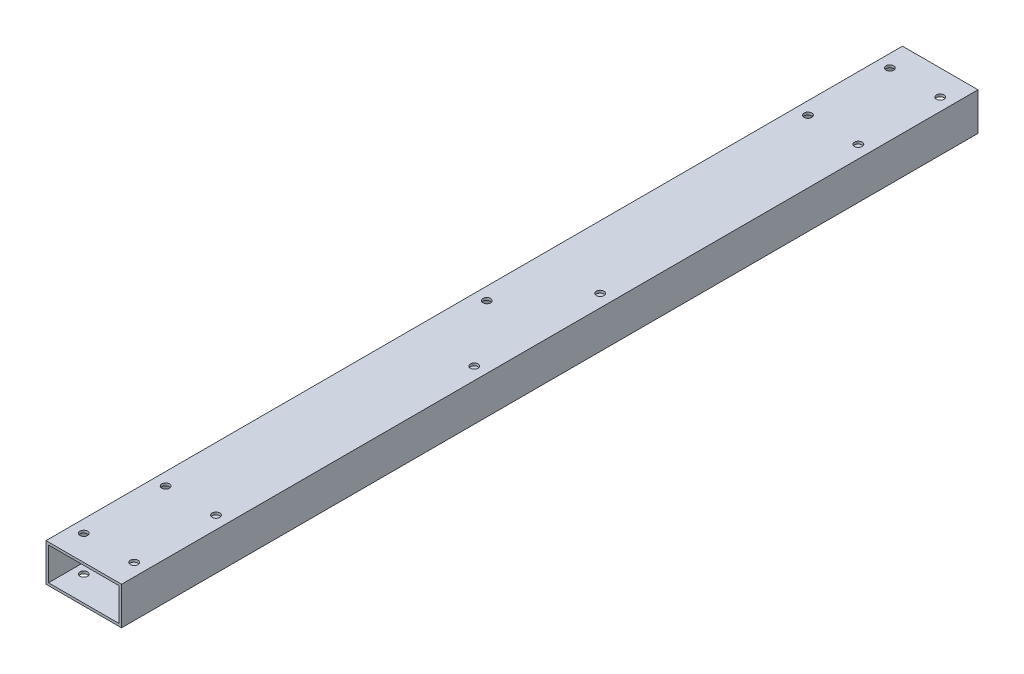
ISO-10303-21;
HEADER;
FILE_DESCRIPTION(('STEP AP214'),'2;1');
FILE_NAME('part.step','',(''),(''),'','','');
FILE_SCHEMA(('AUTOMOTIVE_DESIGN { 1 0 10303 214 1 1 1 1 }'));
ENDSEC;
DATA;
#1=APPLICATION_CONTEXT('core data for automotive mechanical design processes');
#2=APPLICATION_PROTOCOL_DEFINITION('international standard','automotive_design',2000,#1);
#3=PRODUCT_CONTEXT('',#1,'mechanical');
#4=PRODUCT('Part','Part','',(#3));
#5=PRODUCT_RELATED_PRODUCT_CATEGORY('part','',(#4));
#6=PRODUCT_DEFINITION_FORMATION('','',#4);
#7=PRODUCT_DEFINITION_CONTEXT('part definition',#1,'design');
#8=PRODUCT_DEFINITION('design','',#6,#7);
#9=PRODUCT_DEFINITION_SHAPE('','',#8);
#10=(LENGTH_UNIT() NAMED_UNIT(*) SI_UNIT(.MILLI.,.METRE.));
#11=(NAMED_UNIT(*) PLANE_ANGLE_UNIT() SI_UNIT($,.RADIAN.));
#12=(NAMED_UNIT(*) SI_UNIT($,.STERADIAN.) SOLID_ANGLE_UNIT());
#13=UNCERTAINTY_MEASURE_WITH_UNIT(LENGTH_MEASURE(1.E-05),#10,'distance_accuracy_value','');
#14=(GEOMETRIC_REPRESENTATION_CONTEXT(3) GLOBAL_UNCERTAINTY_ASSIGNED_CONTEXT((#13)) GLOBAL_UNIT_ASSIGNED_CONTEXT((#10,
#11,#12)) REPRESENTATION_CONTEXT('',''));
#15=CARTESIAN_POINT('',(0.,0.,0.));
#16=DIRECTION('',(0.,0.,1.));
#17=DIRECTION('',(1.,0.,0.));
#18=AXIS2_PLACEMENT_3D('',#15,#16,#17);
#19=CARTESIAN_POINT('',(0.,0.,340.));
#20=DIRECTION('',(0.,0.,1.));
#21=DIRECTION('',(1.,0.,0.));
#22=AXIS2_PLACEMENT_3D('',#19,#20,#21);
#23=PLANE('',#22);
#24=DIRECTION('',(0.,-1.,0.));
#25=VECTOR('',#24,1.);
#26=CARTESIAN_POINT('',(-30.,15.,340.));
#27=LINE('',#26,#25);
#28=CARTESIAN_POINT('',(-30.,15.,340.));
#29=VERTEX_POINT('',#28);
#30=CARTESIAN_POINT('',(-30.,-15.,340.));
#31=VERTEX_POINT('',#30);
#32=EDGE_CURVE('E198',#29,#31,#27,.T.);
#33=ORIENTED_EDGE('',*,*,#32,.T.);
#34=DIRECTION('',(1.,0.,0.));
#35=VECTOR('',#34,1.);
#36=CARTESIAN_POINT('',(-30.,-15.,340.));
#37=LINE('',#36,#35);
#38=CARTESIAN_POINT('',(30.,-15.,340.));
#39=VERTEX_POINT('',#38);
#40=EDGE_CURVE('E202',#31,#39,#37,.T.);
#41=ORIENTED_EDGE('',*,*,#40,.T.);
#42=DIRECTION('',(0.,1.,0.));
#43=VECTOR('',#42,1.);
#44=CARTESIAN_POINT('',(30.,15.,340.));
#45=LINE('',#44,#43);
#46=CARTESIAN_POINT('',(30.,15.,340.));
#47=VERTEX_POINT('',#46);
#48=EDGE_CURVE('E206',#39,#47,#45,.T.);
#49=ORIENTED_EDGE('',*,*,#48,.T.);
#50=DIRECTION('',(-1.,0.,0.));
#51=VECTOR('',#50,1.);
#52=CARTESIAN_POINT('',(-30.,15.,340.));
#53=LINE('',#52,#51);
#54=EDGE_CURVE('E209',#47,#29,#53,.T.);
#55=ORIENTED_EDGE('',*,*,#54,.T.);
#56=EDGE_LOOP('',(#33,#41,#49,#55));
#57=FACE_BOUND('',#56,.T.);
#58=DIRECTION('',(1.,0.,0.));
#59=VECTOR('',#58,1.);
#60=CARTESIAN_POINT('',(-28.,-13.,340.));
#61=LINE('',#60,#59);
#62=CARTESIAN_POINT('',(-28.,-13.,340.));
#63=VERTEX_POINT('',#62);
#64=CARTESIAN_POINT('',(28.,-13.,340.));
#65=VERTEX_POINT('',#64);
#66=EDGE_CURVE('E143',#63,#65,#61,.T.);
#67=ORIENTED_EDGE('',*,*,#66,.F.);
#68=DIRECTION('',(0.,-1.,0.));
#69=VECTOR('',#68,1.);
#70=CARTESIAN_POINT('',(-28.,13.,340.));
#71=LINE('',#70,#69);
#72=CARTESIAN_POINT('',(-28.,13.,340.));
#73=VERTEX_POINT('',#72);
#74=EDGE_CURVE('E133',#73,#63,#71,.T.);
#75=ORIENTED_EDGE('',*,*,#74,.F.);
#76=DIRECTION('',(-1.,0.,0.));
#77=VECTOR('',#76,1.);
#78=CARTESIAN_POINT('',(-28.,13.,340.));
#79=LINE('',#78,#77);
#80=CARTESIAN_POINT('',(28.,13.,340.));
#81=VERTEX_POINT('',#80);
#82=EDGE_CURVE('E163',#81,#73,#79,.T.);
#83=ORIENTED_EDGE('',*,*,#82,.F.);
#84=DIRECTION('',(0.,1.,0.));
#85=VECTOR('',#84,1.);
#86=CARTESIAN_POINT('',(28.,13.,340.));
#87=LINE('',#86,#85);
#88=EDGE_CURVE('E159',#65,#81,#87,.T.);
#89=ORIENTED_EDGE('',*,*,#88,.F.);
#90=EDGE_LOOP('',(#67,#75,#83,#89));
#91=FACE_BOUND('',#90,.T.);
#92=ADVANCED_FACE('F45',(#57,#91),#23,.T.);
#93=CARTESIAN_POINT('',(0.,0.,-340.));
#94=DIRECTION('',(0.,0.,1.));
#95=DIRECTION('',(1.,0.,0.));
#96=AXIS2_PLACEMENT_3D('',#93,#94,#95);
#97=PLANE('',#96);
#98=DIRECTION('',(0.,-1.,0.));
#99=VECTOR('',#98,1.);
#100=CARTESIAN_POINT('',(-30.,15.,-340.));
#101=LINE('',#100,#99);
#102=CARTESIAN_POINT('',(-30.,15.,-340.));
#103=VERTEX_POINT('',#102);
#104=CARTESIAN_POINT('',(-30.,-15.,-340.));
#105=VERTEX_POINT('',#104);
#106=EDGE_CURVE('E153',#103,#105,#101,.T.);
#107=ORIENTED_EDGE('',*,*,#106,.F.);
#108=DIRECTION('',(-1.,0.,0.));
#109=VECTOR('',#108,1.);
#110=CARTESIAN_POINT('',(-30.,15.,-340.));
#111=LINE('',#110,#109);
#112=CARTESIAN_POINT('',(30.,15.,-340.));
#113=VERTEX_POINT('',#112);
#114=EDGE_CURVE('E203',#113,#103,#111,.T.);
#115=ORIENTED_EDGE('',*,*,#114,.F.);
#116=DIRECTION('',(0.,1.,0.));
#117=VECTOR('',#116,1.);
#118=CARTESIAN_POINT('',(30.,15.,-340.));
#119=LINE('',#118,#117);
#120=CARTESIAN_POINT('',(30.,-15.,-340.));
#121=VERTEX_POINT('',#120);
#122=EDGE_CURVE('E219',#121,#113,#119,.T.);
#123=ORIENTED_EDGE('',*,*,#122,.F.);
#124=DIRECTION('',(1.,0.,0.));
#125=VECTOR('',#124,1.);
#126=CARTESIAN_POINT('',(-30.,-15.,-340.));
#127=LINE('',#126,#125);
#128=EDGE_CURVE('E216',#105,#121,#127,.T.);
#129=ORIENTED_EDGE('',*,*,#128,.F.);
#130=EDGE_LOOP('',(#107,#115,#123,#129));
#131=FACE_BOUND('',#130,.T.);
#132=DIRECTION('',(0.,-1.,0.));
#133=VECTOR('',#132,1.);
#134=CARTESIAN_POINT('',(-28.,13.,-340.));
#135=LINE('',#134,#133);
#136=CARTESIAN_POINT('',(-28.,13.,-340.));
#137=VERTEX_POINT('',#136);
#138=CARTESIAN_POINT('',(-28.,-13.,-340.));
#139=VERTEX_POINT('',#138);
#140=EDGE_CURVE('E169',#137,#139,#135,.T.);
#141=ORIENTED_EDGE('',*,*,#140,.T.);
#142=DIRECTION('',(1.,0.,0.));
#143=VECTOR('',#142,1.);
#144=CARTESIAN_POINT('',(-28.,-13.,-340.));
#145=LINE('',#144,#143);
#146=CARTESIAN_POINT('',(28.,-13.,-340.));
#147=VERTEX_POINT('',#146);
#148=EDGE_CURVE('E173',#139,#147,#145,.T.);
#149=ORIENTED_EDGE('',*,*,#148,.T.);
#150=DIRECTION('',(0.,1.,0.));
#151=VECTOR('',#150,1.);
#152=CARTESIAN_POINT('',(28.,13.,-340.));
#153=LINE('',#152,#151);
#154=CARTESIAN_POINT('',(28.,13.,-340.));
#155=VERTEX_POINT('',#154);
#156=EDGE_CURVE('E178',#147,#155,#153,.T.);
#157=ORIENTED_EDGE('',*,*,#156,.T.);
#158=DIRECTION('',(-1.,0.,0.));
#159=VECTOR('',#158,1.);
#160=CARTESIAN_POINT('',(-28.,13.,-340.));
#161=LINE('',#160,#159);
#162=EDGE_CURVE('E144',#155,#137,#161,.T.);
#163=ORIENTED_EDGE('',*,*,#162,.T.);
#164=EDGE_LOOP('',(#141,#149,#157,#163));
#165=FACE_BOUND('',#164,.T.);
#166=ADVANCED_FACE('F391',(#131,#165),#97,.F.);
#167=CARTESIAN_POINT('',(-30.,15.,340.));
#168=DIRECTION('',(1.,0.,0.));
#169=DIRECTION('',(0.,0.,-1.));
#170=AXIS2_PLACEMENT_3D('',#167,#168,#169);
#171=PLANE('',#170);
#172=ORIENTED_EDGE('',*,*,#106,.T.);
#173=DIRECTION('',(0.,0.,-1.));
#174=VECTOR('',#173,1.);
#175=CARTESIAN_POINT('',(-30.,-15.,340.));
#176=LINE('',#175,#174);
#177=EDGE_CURVE('E11',#31,#105,#176,.T.);
#178=ORIENTED_EDGE('',*,*,#177,.F.);
#179=ORIENTED_EDGE('',*,*,#32,.F.);
#180=DIRECTION('',(0.,0.,-1.));
#181=VECTOR('',#180,1.);
#182=CARTESIAN_POINT('',(-30.,15.,340.));
#183=LINE('',#182,#181);
#184=EDGE_CURVE('E212',#29,#103,#183,.T.);
#185=ORIENTED_EDGE('',*,*,#184,.T.);
#186=EDGE_LOOP('',(#172,#178,#179,#185));
#187=FACE_BOUND('',#186,.T.);
#188=ADVANCED_FACE('F47',(#187),#171,.F.);
#189=CARTESIAN_POINT('',(-30.,-15.,340.));
#190=DIRECTION('',(0.,1.,0.));
#191=DIRECTION('',(0.,0.,1.));
#192=AXIS2_PLACEMENT_3D('',#189,#190,#191);
#193=PLANE('',#192);
#194=CARTESIAN_POINT('',(20.,-15.,50.));
#195=DIRECTION('',(0.,-1.,0.));
#196=DIRECTION('',(0.,0.,-1.));
#197=AXIS2_PLACEMENT_3D('',#194,#195,#196);
#198=CIRCLE('',#197,8.00000000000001);
#199=CARTESIAN_POINT('',(20.,-15.,42.));
#200=VERTEX_POINT('',#199);
#201=EDGE_CURVE('E419',#200,#200,#198,.T.);
#202=ORIENTED_EDGE('',*,*,#201,.F.);
#203=EDGE_LOOP('',(#202));
#204=FACE_BOUND('',#203,.T.);
#205=CARTESIAN_POINT('',(-20.,-15.,255.));
#206=DIRECTION('',(0.,-1.,0.));
#207=DIRECTION('',(0.,0.,-1.));
#208=AXIS2_PLACEMENT_3D('',#205,#206,#207);
#209=CIRCLE('',#208,8.00000000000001);
#210=CARTESIAN_POINT('',(-20.,-15.,247.));
#211=VERTEX_POINT('',#210);
#212=EDGE_CURVE('E423',#211,#211,#209,.T.);
#213=ORIENTED_EDGE('',*,*,#212,.F.);
#214=EDGE_LOOP('',(#213));
#215=FACE_BOUND('',#214,.T.);
#216=CARTESIAN_POINT('',(20.,-15.,255.));
#217=DIRECTION('',(0.,-1.,0.));
#218=DIRECTION('',(0.,0.,-1.));
#219=AXIS2_PLACEMENT_3D('',#216,#217,#218);
#220=CIRCLE('',#219,8.00000000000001);
#221=CARTESIAN_POINT('',(20.,-15.,247.));
#222=VERTEX_POINT('',#221);
#223=EDGE_CURVE('E427',#222,#222,#220,.T.);
#224=ORIENTED_EDGE('',*,*,#223,.F.);
#225=EDGE_LOOP('',(#224));
#226=FACE_BOUND('',#225,.T.);
#227=CARTESIAN_POINT('',(20.,-15.,320.));
#228=DIRECTION('',(0.,-1.,0.));
#229=DIRECTION('',(0.,0.,-1.));
#230=AXIS2_PLACEMENT_3D('',#227,#228,#229);
#231=CIRCLE('',#230,3.05000000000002);
#232=CARTESIAN_POINT('',(20.,-15.,316.95));
#233=VERTEX_POINT('',#232);
#234=EDGE_CURVE('E431',#233,#233,#231,.T.);
#235=ORIENTED_EDGE('',*,*,#234,.F.);
#236=EDGE_LOOP('',(#235));
#237=FACE_BOUND('',#236,.T.);
#238=CARTESIAN_POINT('',(-20.,-15.,320.));
#239=DIRECTION('',(0.,-1.,0.));
#240=DIRECTION('',(0.,0.,-1.));
#241=AXIS2_PLACEMENT_3D('',#238,#239,#240);
#242=CIRCLE('',#241,3.05000000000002);
#243=CARTESIAN_POINT('',(-20.,-15.,316.95));
#244=VERTEX_POINT('',#243);
#245=EDGE_CURVE('E271',#244,#244,#242,.T.);
#246=ORIENTED_EDGE('',*,*,#245,.F.);
#247=EDGE_LOOP('',(#246));
#248=FACE_BOUND('',#247,.T.);
#249=CARTESIAN_POINT('',(-19.9999999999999,-15.,0.));
#250=DIRECTION('',(0.,1.,0.));
#251=DIRECTION('',(0.,0.,1.));
#252=AXIS2_PLACEMENT_3D('',#249,#250,#251);
#253=CIRCLE('',#252,7.99999999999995);
#254=CARTESIAN_POINT('',(-19.9999999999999,-15.,7.99999999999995));
#255=VERTEX_POINT('',#254);
#256=EDGE_CURVE('E306',#255,#255,#253,.T.);
#257=ORIENTED_EDGE('',*,*,#256,.T.);
#258=EDGE_LOOP('',(#257));
#259=FACE_BOUND('',#258,.T.);
#260=CARTESIAN_POINT('',(20.,-15.,-50.));
#261=DIRECTION('',(0.,1.,0.));
#262=DIRECTION('',(0.,0.,1.));
#263=AXIS2_PLACEMENT_3D('',#260,#261,#262);
#264=CIRCLE('',#263,8.00000000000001);
#265=CARTESIAN_POINT('',(20.,-15.,-42.));
#266=VERTEX_POINT('',#265);
#267=EDGE_CURVE('E312',#266,#266,#264,.T.);
#268=ORIENTED_EDGE('',*,*,#267,.T.);
#269=EDGE_LOOP('',(#268));
#270=FACE_BOUND('',#269,.T.);
#271=CARTESIAN_POINT('',(-20.,-15.,-255.));
#272=DIRECTION('',(0.,1.,0.));
#273=DIRECTION('',(0.,0.,1.));
#274=AXIS2_PLACEMENT_3D('',#271,#272,#273);
#275=CIRCLE('',#274,8.00000000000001);
#276=CARTESIAN_POINT('',(-20.,-15.,-247.));
#277=VERTEX_POINT('',#276);
#278=EDGE_CURVE('E307',#277,#277,#275,.T.);
#279=ORIENTED_EDGE('',*,*,#278,.T.);
#280=EDGE_LOOP('',(#279));
#281=FACE_BOUND('',#280,.T.);
#282=CARTESIAN_POINT('',(20.,-15.,-255.));
#283=DIRECTION('',(0.,1.,0.));
#284=DIRECTION('',(0.,0.,1.));
#285=AXIS2_PLACEMENT_3D('',#282,#283,#284);
#286=CIRCLE('',#285,8.00000000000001);
#287=CARTESIAN_POINT('',(20.,-15.,-247.));
#288=VERTEX_POINT('',#287);
#289=EDGE_CURVE('E311',#288,#288,#286,.T.);
#290=ORIENTED_EDGE('',*,*,#289,.T.);
#291=EDGE_LOOP('',(#290));
#292=FACE_BOUND('',#291,.T.);
#293=CARTESIAN_POINT('',(20.,-15.,-320.));
#294=DIRECTION('',(0.,1.,0.));
#295=DIRECTION('',(0.,0.,1.));
#296=AXIS2_PLACEMENT_3D('',#293,#294,#295);
#297=CIRCLE('',#296,3.05000000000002);
#298=CARTESIAN_POINT('',(20.,-15.,-316.95));
#299=VERTEX_POINT('',#298);
#300=EDGE_CURVE('E338',#299,#299,#297,.T.);
#301=ORIENTED_EDGE('',*,*,#300,.T.);
#302=EDGE_LOOP('',(#301));
#303=FACE_BOUND('',#302,.T.);
#304=CARTESIAN_POINT('',(-20.,-15.,-320.));
#305=DIRECTION('',(0.,1.,0.));
#306=DIRECTION('',(0.,0.,1.));
#307=AXIS2_PLACEMENT_3D('',#304,#305,#306);
#308=CIRCLE('',#307,3.05000000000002);
#309=CARTESIAN_POINT('',(-20.,-15.,-316.95));
#310=VERTEX_POINT('',#309);
#311=EDGE_CURVE('E239',#310,#310,#308,.T.);
#312=ORIENTED_EDGE('',*,*,#311,.T.);
#313=EDGE_LOOP('',(#312));
#314=FACE_BOUND('',#313,.T.);
#315=ORIENTED_EDGE('',*,*,#128,.T.);
#316=DIRECTION('',(0.,0.,-1.));
#317=VECTOR('',#316,1.);
#318=CARTESIAN_POINT('',(30.,-15.,340.));
#319=LINE('',#318,#317);
#320=EDGE_CURVE('E55',#39,#121,#319,.T.);
#321=ORIENTED_EDGE('',*,*,#320,.F.);
#322=ORIENTED_EDGE('',*,*,#40,.F.);
#323=ORIENTED_EDGE('',*,*,#177,.T.);
#324=EDGE_LOOP('',(#315,#321,#322,#323));
#325=FACE_BOUND('',#324,.T.);
#326=ADVANCED_FACE('F407',(#204,#215,#226,#237,#248,#259,#270,#281,#292,#303,#314,#325),#193,.F.);
#327=CARTESIAN_POINT('',(30.,15.,340.));
#328=DIRECTION('',(-1.,0.,0.));
#329=DIRECTION('',(0.,0.,1.));
#330=AXIS2_PLACEMENT_3D('',#327,#328,#329);
#331=PLANE('',#330);
#332=ORIENTED_EDGE('',*,*,#122,.T.);
#333=DIRECTION('',(0.,0.,-1.));
#334=VECTOR('',#333,1.);
#335=CARTESIAN_POINT('',(30.,15.,340.));
#336=LINE('',#335,#334);
#337=EDGE_CURVE('E227',#47,#113,#336,.T.);
#338=ORIENTED_EDGE('',*,*,#337,.F.);
#339=ORIENTED_EDGE('',*,*,#48,.F.);
#340=ORIENTED_EDGE('',*,*,#320,.T.);
#341=EDGE_LOOP('',(#332,#338,#339,#340));
#342=FACE_BOUND('',#341,.T.);
#343=ADVANCED_FACE('F404',(#342),#331,.F.);
#344=CARTESIAN_POINT('',(-30.,15.,340.));
#345=DIRECTION('',(0.,-1.,0.));
#346=DIRECTION('',(0.,0.,-1.));
#347=AXIS2_PLACEMENT_3D('',#344,#345,#346);
#348=PLANE('',#347);
#349=CARTESIAN_POINT('',(20.,15.,255.));
#350=DIRECTION('',(0.,-1.,0.));
#351=DIRECTION('',(0.,0.,-1.));
#352=AXIS2_PLACEMENT_3D('',#349,#350,#351);
#353=CIRCLE('',#352,3.05000000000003);
#354=CARTESIAN_POINT('',(20.,15.,251.95));
#355=VERTEX_POINT('',#354);
#356=EDGE_CURVE('E302',#355,#355,#353,.F.);
#357=ORIENTED_EDGE('',*,*,#356,.F.);
#358=EDGE_LOOP('',(#357));
#359=FACE_BOUND('',#358,.T.);
#360=CARTESIAN_POINT('',(-20.,15.,255.));
#361=DIRECTION('',(0.,-1.,0.));
#362=DIRECTION('',(0.,0.,-1.));
#363=AXIS2_PLACEMENT_3D('',#360,#361,#362);
#364=CIRCLE('',#363,3.05000000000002);
#365=CARTESIAN_POINT('',(-20.,15.,251.95));
#366=VERTEX_POINT('',#365);
#367=EDGE_CURVE('E285',#366,#366,#364,.F.);
#368=ORIENTED_EDGE('',*,*,#367,.F.);
#369=EDGE_LOOP('',(#368));
#370=FACE_BOUND('',#369,.T.);
#371=CARTESIAN_POINT('',(20.,15.,320.));
#372=DIRECTION('',(0.,-1.,0.));
#373=DIRECTION('',(0.,0.,-1.));
#374=AXIS2_PLACEMENT_3D('',#371,#372,#373);
#375=CIRCLE('',#374,3.05000000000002);
#376=CARTESIAN_POINT('',(20.,15.,316.95));
#377=VERTEX_POINT('',#376);
#378=EDGE_CURVE('E286',#377,#377,#375,.F.);
#379=ORIENTED_EDGE('',*,*,#378,.F.);
#380=EDGE_LOOP('',(#379));
#381=FACE_BOUND('',#380,.T.);
#382=CARTESIAN_POINT('',(20.,15.,50.));
#383=DIRECTION('',(0.,-1.,0.));
#384=DIRECTION('',(0.,0.,-1.));
#385=AXIS2_PLACEMENT_3D('',#382,#383,#384);
#386=CIRCLE('',#385,3.05);
#387=CARTESIAN_POINT('',(20.,15.,46.95));
#388=VERTEX_POINT('',#387);
#389=EDGE_CURVE('E276',#388,#388,#386,.F.);
#390=ORIENTED_EDGE('',*,*,#389,.F.);
#391=EDGE_LOOP('',(#390));
#392=FACE_BOUND('',#391,.T.);
#393=CARTESIAN_POINT('',(-20.,15.,320.));
#394=DIRECTION('',(0.,-1.,0.));
#395=DIRECTION('',(0.,0.,-1.));
#396=AXIS2_PLACEMENT_3D('',#393,#394,#395);
#397=CIRCLE('',#396,3.05000000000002);
#398=CARTESIAN_POINT('',(-20.,15.,316.95));
#399=VERTEX_POINT('',#398);
#400=EDGE_CURVE('E277',#399,#399,#397,.F.);
#401=ORIENTED_EDGE('',*,*,#400,.F.);
#402=EDGE_LOOP('',(#401));
#403=FACE_BOUND('',#402,.T.);
#404=CARTESIAN_POINT('',(-19.9999999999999,15.,0.));
#405=DIRECTION('',(0.,-1.,0.));
#406=DIRECTION('',(0.,0.,-1.));
#407=AXIS2_PLACEMENT_3D('',#404,#405,#406);
#408=CIRCLE('',#407,3.05);
#409=CARTESIAN_POINT('',(-19.9999999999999,15.,-3.05));
#410=VERTEX_POINT('',#409);
#411=EDGE_CURVE('E174',#410,#410,#408,.T.);
#412=ORIENTED_EDGE('',*,*,#411,.T.);
#413=EDGE_LOOP('',(#412));
#414=FACE_BOUND('',#413,.T.);
#415=CARTESIAN_POINT('',(20.,15.,-255.));
#416=DIRECTION('',(0.,-1.,0.));
#417=DIRECTION('',(0.,0.,-1.));
#418=AXIS2_PLACEMENT_3D('',#415,#416,#417);
#419=CIRCLE('',#418,3.05000000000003);
#420=CARTESIAN_POINT('',(20.,15.,-258.05));
#421=VERTEX_POINT('',#420);
#422=EDGE_CURVE('E261',#421,#421,#419,.T.);
#423=ORIENTED_EDGE('',*,*,#422,.T.);
#424=EDGE_LOOP('',(#423));
#425=FACE_BOUND('',#424,.T.);
#426=CARTESIAN_POINT('',(-20.,15.,-255.));
#427=DIRECTION('',(0.,-1.,0.));
#428=DIRECTION('',(0.,0.,-1.));
#429=AXIS2_PLACEMENT_3D('',#426,#427,#428);
#430=CIRCLE('',#429,3.05000000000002);
#431=CARTESIAN_POINT('',(-20.,15.,-258.05));
#432=VERTEX_POINT('',#431);
#433=EDGE_CURVE('E255',#432,#432,#430,.T.);
#434=ORIENTED_EDGE('',*,*,#433,.T.);
#435=EDGE_LOOP('',(#434));
#436=FACE_BOUND('',#435,.T.);
#437=CARTESIAN_POINT('',(20.,15.,-320.));
#438=DIRECTION('',(0.,-1.,0.));
#439=DIRECTION('',(0.,0.,-1.));
#440=AXIS2_PLACEMENT_3D('',#437,#438,#439);
#441=CIRCLE('',#440,3.05000000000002);
#442=CARTESIAN_POINT('',(20.,15.,-323.05));
#443=VERTEX_POINT('',#442);
#444=EDGE_CURVE('E256',#443,#443,#441,.T.);
#445=ORIENTED_EDGE('',*,*,#444,.T.);
#446=EDGE_LOOP('',(#445));
#447=FACE_BOUND('',#446,.T.);
#448=CARTESIAN_POINT('',(20.,15.,-50.));
#449=DIRECTION('',(0.,-1.,0.));
#450=DIRECTION('',(0.,0.,-1.));
#451=AXIS2_PLACEMENT_3D('',#448,#449,#450);
#452=CIRCLE('',#451,3.05);
#453=CARTESIAN_POINT('',(20.,15.,-53.05));
#454=VERTEX_POINT('',#453);
#455=EDGE_CURVE('E244',#454,#454,#452,.T.);
#456=ORIENTED_EDGE('',*,*,#455,.T.);
#457=EDGE_LOOP('',(#456));
#458=FACE_BOUND('',#457,.T.);
#459=CARTESIAN_POINT('',(-20.,15.,-320.));
#460=DIRECTION('',(0.,-1.,0.));
#461=DIRECTION('',(0.,0.,-1.));
#462=AXIS2_PLACEMENT_3D('',#459,#460,#461);
#463=CIRCLE('',#462,3.05000000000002);
#464=CARTESIAN_POINT('',(-20.,15.,-323.05));
#465=VERTEX_POINT('',#464);
#466=EDGE_CURVE('E245',#465,#465,#463,.T.);
#467=ORIENTED_EDGE('',*,*,#466,.T.);
#468=EDGE_LOOP('',(#467));
#469=FACE_BOUND('',#468,.T.);
#470=ORIENTED_EDGE('',*,*,#114,.T.);
#471=ORIENTED_EDGE('',*,*,#184,.F.);
#472=ORIENTED_EDGE('',*,*,#54,.F.);
#473=ORIENTED_EDGE('',*,*,#337,.T.);
#474=EDGE_LOOP('',(#470,#471,#472,#473));
#475=FACE_BOUND('',#474,.T.);
#476=ADVANCED_FACE('F369',(#359,#370,#381,#392,#403,#414,#425,#436,#447,#458,#469,#475),#348,.F.);
#477=CARTESIAN_POINT('',(-28.,13.,340.));
#478=DIRECTION('',(1.,0.,0.));
#479=DIRECTION('',(0.,1.,0.));
#480=AXIS2_PLACEMENT_3D('',#477,#478,#479);
#481=PLANE('',#480);
#482=DIRECTION('',(0.,0.,-1.));
#483=VECTOR('',#482,1.);
#484=CARTESIAN_POINT('',(-28.,-13.,340.));
#485=LINE('',#484,#483);
#486=CARTESIAN_POINT('',(-28.,-13.,255.));
#487=VERTEX_POINT('',#486);
#488=EDGE_CURVE('E136',#63,#487,#485,.T.);
#489=ORIENTED_EDGE('',*,*,#488,.T.);
#490=CARTESIAN_POINT('',(-28.,-13.,0.));
#491=VERTEX_POINT('',#490);
#492=EDGE_CURVE('E154',#487,#491,#485,.T.);
#493=ORIENTED_EDGE('',*,*,#492,.T.);
#494=CARTESIAN_POINT('',(-28.,-13.,-255.));
#495=VERTEX_POINT('',#494);
#496=EDGE_CURVE('E156',#491,#495,#485,.T.);
#497=ORIENTED_EDGE('',*,*,#496,.T.);
#498=EDGE_CURVE('E193',#495,#139,#485,.T.);
#499=ORIENTED_EDGE('',*,*,#498,.T.);
#500=ORIENTED_EDGE('',*,*,#140,.F.);
#501=DIRECTION('',(0.,0.,-1.));
#502=VECTOR('',#501,1.);
#503=CARTESIAN_POINT('',(-28.,13.,340.));
#504=LINE('',#503,#502);
#505=EDGE_CURVE('E138',#73,#137,#504,.T.);
#506=ORIENTED_EDGE('',*,*,#505,.F.);
#507=ORIENTED_EDGE('',*,*,#74,.T.);
#508=EDGE_LOOP('',(#489,#493,#497,#499,#500,#506,#507));
#509=FACE_BOUND('',#508,.T.);
#510=ADVANCED_FACE('F135',(#509),#481,.T.);
#511=CARTESIAN_POINT('',(-28.,-13.,340.));
#512=DIRECTION('',(0.,1.,0.));
#513=DIRECTION('',(0.,0.,1.));
#514=AXIS2_PLACEMENT_3D('',#511,#512,#513);
#515=PLANE('',#514);
#516=CARTESIAN_POINT('',(20.,-13.,320.));
#517=DIRECTION('',(0.,1.,0.));
#518=DIRECTION('',(0.,0.,1.));
#519=AXIS2_PLACEMENT_3D('',#516,#517,#518);
#520=CIRCLE('',#519,3.05000000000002);
#521=CARTESIAN_POINT('',(20.,-13.,323.05));
#522=VERTEX_POINT('',#521);
#523=EDGE_CURVE('E281',#522,#522,#520,.F.);
#524=ORIENTED_EDGE('',*,*,#523,.T.);
#525=EDGE_LOOP('',(#524));
#526=FACE_BOUND('',#525,.T.);
#527=CARTESIAN_POINT('',(-20.,-13.,320.));
#528=DIRECTION('',(0.,1.,0.));
#529=DIRECTION('',(0.,0.,1.));
#530=AXIS2_PLACEMENT_3D('',#527,#528,#529);
#531=CIRCLE('',#530,3.05000000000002);
#532=CARTESIAN_POINT('',(-20.,-13.,323.05));
#533=VERTEX_POINT('',#532);
#534=EDGE_CURVE('E270',#533,#533,#531,.F.);
#535=ORIENTED_EDGE('',*,*,#534,.T.);
#536=EDGE_LOOP('',(#535));
#537=FACE_BOUND('',#536,.T.);
#538=CARTESIAN_POINT('',(20.,-13.,-320.));
#539=DIRECTION('',(0.,1.,0.));
#540=DIRECTION('',(0.,0.,1.));
#541=AXIS2_PLACEMENT_3D('',#538,#539,#540);
#542=CIRCLE('',#541,3.05000000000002);
#543=CARTESIAN_POINT('',(20.,-13.,-316.95));
#544=VERTEX_POINT('',#543);
#545=EDGE_CURVE('E250',#544,#544,#542,.T.);
#546=ORIENTED_EDGE('',*,*,#545,.F.);
#547=EDGE_LOOP('',(#546));
#548=FACE_BOUND('',#547,.T.);
#549=CARTESIAN_POINT('',(-20.,-13.,-320.));
#550=DIRECTION('',(0.,1.,0.));
#551=DIRECTION('',(0.,0.,1.));
#552=AXIS2_PLACEMENT_3D('',#549,#550,#551);
#553=CIRCLE('',#552,3.05000000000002);
#554=CARTESIAN_POINT('',(-20.,-13.,-316.95));
#555=VERTEX_POINT('',#554);
#556=EDGE_CURVE('E238',#555,#555,#553,.T.);
#557=ORIENTED_EDGE('',*,*,#556,.F.);
#558=EDGE_LOOP('',(#557));
#559=FACE_BOUND('',#558,.T.);
#560=DIRECTION('',(0.,0.,-1.));
#561=VECTOR('',#560,1.);
#562=CARTESIAN_POINT('',(28.,-13.,340.));
#563=LINE('',#562,#561);
#564=CARTESIAN_POINT('',(28.,-13.,255.));
#565=VERTEX_POINT('',#564);
#566=CARTESIAN_POINT('',(28.,-13.,50.));
#567=VERTEX_POINT('',#566);
#568=EDGE_CURVE('E194',#565,#567,#563,.T.);
#569=ORIENTED_EDGE('',*,*,#568,.T.);
#570=CARTESIAN_POINT('',(20.,-13.,50.));
#571=DIRECTION('',(0.,1.,0.));
#572=DIRECTION('',(0.,0.,1.));
#573=AXIS2_PLACEMENT_3D('',#570,#571,#572);
#574=CIRCLE('',#573,8.00000000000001);
#575=EDGE_CURVE('E66',#567,#567,#574,.T.);
#576=ORIENTED_EDGE('',*,*,#575,.F.);
#577=CARTESIAN_POINT('',(28.,-13.,-50.));
#578=VERTEX_POINT('',#577);
#579=EDGE_CURVE('E195',#567,#578,#563,.T.);
#580=ORIENTED_EDGE('',*,*,#579,.T.);
#581=CARTESIAN_POINT('',(20.,-13.,-50.));
#582=DIRECTION('',(0.,1.,0.));
#583=DIRECTION('',(0.,0.,1.));
#584=AXIS2_PLACEMENT_3D('',#581,#582,#583);
#585=CIRCLE('',#584,8.00000000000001);
#586=EDGE_CURVE('E330',#578,#578,#585,.F.);
#587=ORIENTED_EDGE('',*,*,#586,.T.);
#588=CARTESIAN_POINT('',(28.,-13.,-255.));
#589=VERTEX_POINT('',#588);
#590=EDGE_CURVE('E196',#578,#589,#563,.T.);
#591=ORIENTED_EDGE('',*,*,#590,.T.);
#592=CARTESIAN_POINT('',(20.,-13.,-255.));
#593=DIRECTION('',(0.,1.,0.));
#594=DIRECTION('',(0.,0.,1.));
#595=AXIS2_PLACEMENT_3D('',#592,#593,#594);
#596=CIRCLE('',#595,8.00000000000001);
#597=EDGE_CURVE('E322',#589,#589,#596,.F.);
#598=ORIENTED_EDGE('',*,*,#597,.T.);
#599=EDGE_CURVE('E190',#589,#147,#563,.T.);
#600=ORIENTED_EDGE('',*,*,#599,.T.);
#601=ORIENTED_EDGE('',*,*,#148,.F.);
#602=ORIENTED_EDGE('',*,*,#498,.F.);
#603=CARTESIAN_POINT('',(-20.,-13.,-255.));
#604=DIRECTION('',(0.,1.,0.));
#605=DIRECTION('',(0.,0.,1.));
#606=AXIS2_PLACEMENT_3D('',#603,#604,#605);
#607=CIRCLE('',#606,8.00000000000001);
#608=EDGE_CURVE('E326',#495,#495,#607,.F.);
#609=ORIENTED_EDGE('',*,*,#608,.T.);
#610=ORIENTED_EDGE('',*,*,#496,.F.);
#611=CARTESIAN_POINT('',(-19.9999999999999,-13.,0.));
#612=DIRECTION('',(0.,1.,0.));
#613=DIRECTION('',(0.,0.,1.));
#614=AXIS2_PLACEMENT_3D('',#611,#612,#613);
#615=CIRCLE('',#614,7.99999999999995);
#616=EDGE_CURVE('E334',#491,#491,#615,.F.);
#617=ORIENTED_EDGE('',*,*,#616,.T.);
#618=ORIENTED_EDGE('',*,*,#492,.F.);
#619=CARTESIAN_POINT('',(-20.,-13.,255.));
#620=DIRECTION('',(0.,1.,0.));
#621=DIRECTION('',(0.,0.,1.));
#622=AXIS2_PLACEMENT_3D('',#619,#620,#621);
#623=CIRCLE('',#622,8.00000000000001);
#624=EDGE_CURVE('E61',#487,#487,#623,.T.);
#625=ORIENTED_EDGE('',*,*,#624,.F.);
#626=ORIENTED_EDGE('',*,*,#488,.F.);
#627=ORIENTED_EDGE('',*,*,#66,.T.);
#628=EDGE_CURVE('E191',#65,#565,#563,.T.);
#629=ORIENTED_EDGE('',*,*,#628,.T.);
#630=CARTESIAN_POINT('',(20.,-13.,255.));
#631=DIRECTION('',(0.,1.,0.));
#632=DIRECTION('',(0.,0.,1.));
#633=AXIS2_PLACEMENT_3D('',#630,#631,#632);
#634=CIRCLE('',#633,8.00000000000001);
#635=EDGE_CURVE('E517',#565,#565,#634,.T.);
#636=ORIENTED_EDGE('',*,*,#635,.F.);
#637=EDGE_LOOP('',(#569,#576,#580,#587,#591,#598,#600,#601,#602,#609,#610,#617,#618,#625,#626,
#627,#629,#636));
#638=FACE_BOUND('',#637,.T.);
#639=ADVANCED_FACE('F148',(#526,#537,#548,#559,#638),#515,.T.);
#640=CARTESIAN_POINT('',(28.,13.,340.));
#641=DIRECTION('',(-1.,0.,0.));
#642=DIRECTION('',(0.,0.,1.));
#643=AXIS2_PLACEMENT_3D('',#640,#641,#642);
#644=PLANE('',#643);
#645=ORIENTED_EDGE('',*,*,#579,.F.);
#646=ORIENTED_EDGE('',*,*,#568,.F.);
#647=ORIENTED_EDGE('',*,*,#628,.F.);
#648=ORIENTED_EDGE('',*,*,#88,.T.);
#649=DIRECTION('',(0.,0.,-1.));
#650=VECTOR('',#649,1.);
#651=CARTESIAN_POINT('',(28.,13.,340.));
#652=LINE('',#651,#650);
#653=EDGE_CURVE('E187',#81,#155,#652,.T.);
#654=ORIENTED_EDGE('',*,*,#653,.T.);
#655=ORIENTED_EDGE('',*,*,#156,.F.);
#656=ORIENTED_EDGE('',*,*,#599,.F.);
#657=ORIENTED_EDGE('',*,*,#590,.F.);
#658=EDGE_LOOP('',(#645,#646,#647,#648,#654,#655,#656,#657));
#659=FACE_BOUND('',#658,.T.);
#660=ADVANCED_FACE('F472',(#659),#644,.T.);
#661=CARTESIAN_POINT('',(-28.,13.,340.));
#662=DIRECTION('',(0.,-1.,0.));
#663=DIRECTION('',(0.,0.,-1.));
#664=AXIS2_PLACEMENT_3D('',#661,#662,#663);
#665=PLANE('',#664);
#666=CARTESIAN_POINT('',(20.,13.,320.));
#667=DIRECTION('',(0.,-1.,0.));
#668=DIRECTION('',(0.,0.,-1.));
#669=AXIS2_PLACEMENT_3D('',#666,#667,#668);
#670=CIRCLE('',#669,3.05000000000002);
#671=CARTESIAN_POINT('',(20.,13.,316.95));
#672=VERTEX_POINT('',#671);
#673=EDGE_CURVE('E278',#672,#672,#670,.F.);
#674=ORIENTED_EDGE('',*,*,#673,.T.);
#675=EDGE_LOOP('',(#674));
#676=FACE_BOUND('',#675,.T.);
#677=CARTESIAN_POINT('',(-20.,13.,320.));
#678=DIRECTION('',(0.,-1.,0.));
#679=DIRECTION('',(0.,0.,-1.));
#680=AXIS2_PLACEMENT_3D('',#677,#678,#679);
#681=CIRCLE('',#680,3.05000000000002);
#682=CARTESIAN_POINT('',(-20.,13.,316.95));
#683=VERTEX_POINT('',#682);
#684=EDGE_CURVE('E266',#683,#683,#681,.F.);
#685=ORIENTED_EDGE('',*,*,#684,.T.);
#686=EDGE_LOOP('',(#685));
#687=FACE_BOUND('',#686,.T.);
#688=CARTESIAN_POINT('',(20.,13.,-320.));
#689=DIRECTION('',(0.,-1.,0.));
#690=DIRECTION('',(0.,0.,-1.));
#691=AXIS2_PLACEMENT_3D('',#688,#689,#690);
#692=CIRCLE('',#691,3.05000000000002);
#693=CARTESIAN_POINT('',(20.,13.,-323.05));
#694=VERTEX_POINT('',#693);
#695=EDGE_CURVE('E246',#694,#694,#692,.T.);
#696=ORIENTED_EDGE('',*,*,#695,.F.);
#697=EDGE_LOOP('',(#696));
#698=FACE_BOUND('',#697,.T.);
#699=CARTESIAN_POINT('',(-20.,13.,-320.));
#700=DIRECTION('',(0.,-1.,0.));
#701=DIRECTION('',(0.,0.,-1.));
#702=AXIS2_PLACEMENT_3D('',#699,#700,#701);
#703=CIRCLE('',#702,3.05000000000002);
#704=CARTESIAN_POINT('',(-20.,13.,-323.05));
#705=VERTEX_POINT('',#704);
#706=EDGE_CURVE('E234',#705,#705,#703,.T.);
#707=ORIENTED_EDGE('',*,*,#706,.F.);
#708=EDGE_LOOP('',(#707));
#709=FACE_BOUND('',#708,.T.);
#710=ORIENTED_EDGE('',*,*,#505,.T.);
#711=ORIENTED_EDGE('',*,*,#162,.F.);
#712=ORIENTED_EDGE('',*,*,#653,.F.);
#713=ORIENTED_EDGE('',*,*,#82,.T.);
#714=EDGE_LOOP('',(#710,#711,#712,#713));
#715=FACE_BOUND('',#714,.T.);
#716=CARTESIAN_POINT('',(20.,13.,-255.));
#717=DIRECTION('',(0.,-1.,0.));
#718=DIRECTION('',(0.,0.,-1.));
#719=AXIS2_PLACEMENT_3D('',#716,#717,#718);
#720=CIRCLE('',#719,3.05000000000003);
#721=CARTESIAN_POINT('',(20.,13.,-258.05));
#722=VERTEX_POINT('',#721);
#723=EDGE_CURVE('E257',#722,#722,#720,.T.);
#724=ORIENTED_EDGE('',*,*,#723,.F.);
#725=EDGE_LOOP('',(#724));
#726=FACE_BOUND('',#725,.T.);
#727=CARTESIAN_POINT('',(-20.,13.,-255.));
#728=DIRECTION('',(0.,-1.,0.));
#729=DIRECTION('',(0.,0.,-1.));
#730=AXIS2_PLACEMENT_3D('',#727,#728,#729);
#731=CIRCLE('',#730,3.05000000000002);
#732=CARTESIAN_POINT('',(-20.,13.,-258.05));
#733=VERTEX_POINT('',#732);
#734=EDGE_CURVE('E251',#733,#733,#731,.T.);
#735=ORIENTED_EDGE('',*,*,#734,.F.);
#736=EDGE_LOOP('',(#735));
#737=FACE_BOUND('',#736,.T.);
#738=CARTESIAN_POINT('',(20.,13.,-50.));
#739=DIRECTION('',(0.,-1.,0.));
#740=DIRECTION('',(0.,0.,-1.));
#741=AXIS2_PLACEMENT_3D('',#738,#739,#740);
#742=CIRCLE('',#741,3.05);
#743=CARTESIAN_POINT('',(20.,13.,-53.05));
#744=VERTEX_POINT('',#743);
#745=EDGE_CURVE('E240',#744,#744,#742,.T.);
#746=ORIENTED_EDGE('',*,*,#745,.F.);
#747=EDGE_LOOP('',(#746));
#748=FACE_BOUND('',#747,.T.);
#749=CARTESIAN_POINT('',(20.,13.,255.));
#750=DIRECTION('',(0.,-1.,0.));
#751=DIRECTION('',(0.,0.,-1.));
#752=AXIS2_PLACEMENT_3D('',#749,#750,#751);
#753=CIRCLE('',#752,3.05000000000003);
#754=CARTESIAN_POINT('',(20.,13.,251.95));
#755=VERTEX_POINT('',#754);
#756=EDGE_CURVE('E49',#755,#755,#753,.F.);
#757=ORIENTED_EDGE('',*,*,#756,.T.);
#758=EDGE_LOOP('',(#757));
#759=FACE_BOUND('',#758,.T.);
#760=CARTESIAN_POINT('',(-20.,13.,255.));
#761=DIRECTION('',(0.,-1.,0.));
#762=DIRECTION('',(0.,0.,-1.));
#763=AXIS2_PLACEMENT_3D('',#760,#761,#762);
#764=CIRCLE('',#763,3.05000000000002);
#765=CARTESIAN_POINT('',(-20.,13.,251.95));
#766=VERTEX_POINT('',#765);
#767=EDGE_CURVE('E282',#766,#766,#764,.F.);
#768=ORIENTED_EDGE('',*,*,#767,.T.);
#769=EDGE_LOOP('',(#768));
#770=FACE_BOUND('',#769,.T.);
#771=CARTESIAN_POINT('',(20.,13.,50.));
#772=DIRECTION('',(0.,-1.,0.));
#773=DIRECTION('',(0.,0.,-1.));
#774=AXIS2_PLACEMENT_3D('',#771,#772,#773);
#775=CIRCLE('',#774,3.05);
#776=CARTESIAN_POINT('',(20.,13.,46.95));
#777=VERTEX_POINT('',#776);
#778=EDGE_CURVE('E272',#777,#777,#775,.F.);
#779=ORIENTED_EDGE('',*,*,#778,.T.);
#780=EDGE_LOOP('',(#779));
#781=FACE_BOUND('',#780,.T.);
#782=CARTESIAN_POINT('',(-19.9999999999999,13.,0.));
#783=DIRECTION('',(0.,-1.,0.));
#784=DIRECTION('',(0.,0.,-1.));
#785=AXIS2_PLACEMENT_3D('',#782,#783,#784);
#786=CIRCLE('',#785,3.05);
#787=CARTESIAN_POINT('',(-19.9999999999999,13.,-3.05));
#788=VERTEX_POINT('',#787);
#789=EDGE_CURVE('E262',#788,#788,#786,.T.);
#790=ORIENTED_EDGE('',*,*,#789,.F.);
#791=EDGE_LOOP('',(#790));
#792=FACE_BOUND('',#791,.T.);
#793=ADVANCED_FACE('F474',(#676,#687,#698,#709,#715,#726,#737,#748,#759,#770,#781,#792),#665,.T.);
#794=CARTESIAN_POINT('',(-20.,-15.,-320.));
#795=DIRECTION('',(0.,1.,0.));
#796=DIRECTION('',(0.,0.,1.));
#797=AXIS2_PLACEMENT_3D('',#794,#795,#796);
#798=CYLINDRICAL_SURFACE('',#797,3.05000000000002);
#799=ORIENTED_EDGE('',*,*,#706,.T.);
#800=EDGE_LOOP('',(#799));
#801=FACE_BOUND('',#800,.T.);
#802=ORIENTED_EDGE('',*,*,#466,.F.);
#803=EDGE_LOOP('',(#802));
#804=FACE_BOUND('',#803,.T.);
#805=ADVANCED_FACE('F385',(#801,#804),#798,.F.);
#806=CARTESIAN_POINT('',(20.,-15.,-50.));
#807=DIRECTION('',(0.,1.,0.));
#808=DIRECTION('',(0.,0.,1.));
#809=AXIS2_PLACEMENT_3D('',#806,#807,#808);
#810=CYLINDRICAL_SURFACE('',#809,3.05);
#811=ORIENTED_EDGE('',*,*,#745,.T.);
#812=EDGE_LOOP('',(#811));
#813=FACE_BOUND('',#812,.T.);
#814=ORIENTED_EDGE('',*,*,#455,.F.);
#815=EDGE_LOOP('',(#814));
#816=FACE_BOUND('',#815,.T.);
#817=ADVANCED_FACE('F570',(#813,#816),#810,.F.);
#818=CARTESIAN_POINT('',(20.,-15.,-320.));
#819=DIRECTION('',(0.,1.,0.));
#820=DIRECTION('',(0.,0.,1.));
#821=AXIS2_PLACEMENT_3D('',#818,#819,#820);
#822=CYLINDRICAL_SURFACE('',#821,3.05000000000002);
#823=ORIENTED_EDGE('',*,*,#695,.T.);
#824=EDGE_LOOP('',(#823));
#825=FACE_BOUND('',#824,.T.);
#826=ORIENTED_EDGE('',*,*,#444,.F.);
#827=EDGE_LOOP('',(#826));
#828=FACE_BOUND('',#827,.T.);
#829=ADVANCED_FACE('F572',(#825,#828),#822,.F.);
#830=CARTESIAN_POINT('',(-20.,-15.,-255.));
#831=DIRECTION('',(0.,1.,0.));
#832=DIRECTION('',(0.,0.,1.));
#833=AXIS2_PLACEMENT_3D('',#830,#831,#832);
#834=CYLINDRICAL_SURFACE('',#833,3.05000000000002);
#835=ORIENTED_EDGE('',*,*,#734,.T.);
#836=EDGE_LOOP('',(#835));
#837=FACE_BOUND('',#836,.T.);
#838=ORIENTED_EDGE('',*,*,#433,.F.);
#839=EDGE_LOOP('',(#838));
#840=FACE_BOUND('',#839,.T.);
#841=ADVANCED_FACE('F386',(#837,#840),#834,.F.);
#842=CARTESIAN_POINT('',(20.,-15.,-255.));
#843=DIRECTION('',(0.,1.,0.));
#844=DIRECTION('',(0.,0.,1.));
#845=AXIS2_PLACEMENT_3D('',#842,#843,#844);
#846=CYLINDRICAL_SURFACE('',#845,3.05000000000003);
#847=ORIENTED_EDGE('',*,*,#723,.T.);
#848=EDGE_LOOP('',(#847));
#849=FACE_BOUND('',#848,.T.);
#850=ORIENTED_EDGE('',*,*,#422,.F.);
#851=EDGE_LOOP('',(#850));
#852=FACE_BOUND('',#851,.T.);
#853=ADVANCED_FACE('F375',(#849,#852),#846,.F.);
#854=CARTESIAN_POINT('',(-19.9999999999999,-15.,0.));
#855=DIRECTION('',(0.,1.,0.));
#856=DIRECTION('',(0.,0.,1.));
#857=AXIS2_PLACEMENT_3D('',#854,#855,#856);
#858=CYLINDRICAL_SURFACE('',#857,3.05);
#859=ORIENTED_EDGE('',*,*,#789,.T.);
#860=EDGE_LOOP('',(#859));
#861=FACE_BOUND('',#860,.T.);
#862=ORIENTED_EDGE('',*,*,#411,.F.);
#863=EDGE_LOOP('',(#862));
#864=FACE_BOUND('',#863,.T.);
#865=ADVANCED_FACE('F372',(#861,#864),#858,.F.);
#866=ORIENTED_EDGE('',*,*,#556,.T.);
#867=EDGE_LOOP('',(#866));
#868=FACE_BOUND('',#867,.T.);
#869=ORIENTED_EDGE('',*,*,#311,.F.);
#870=EDGE_LOOP('',(#869));
#871=FACE_BOUND('',#870,.T.);
#872=ADVANCED_FACE('F374',(#868,#871),#798,.F.);
#873=ORIENTED_EDGE('',*,*,#545,.T.);
#874=EDGE_LOOP('',(#873));
#875=FACE_BOUND('',#874,.T.);
#876=ORIENTED_EDGE('',*,*,#300,.F.);
#877=EDGE_LOOP('',(#876));
#878=FACE_BOUND('',#877,.T.);
#879=ADVANCED_FACE('F382',(#875,#878),#822,.F.);
#880=CARTESIAN_POINT('',(20.,35.6274169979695,-255.));
#881=DIRECTION('',(0.,-1.,0.));
#882=DIRECTION('',(0.,0.,-1.));
#883=AXIS2_PLACEMENT_3D('',#880,#881,#882);
#884=CYLINDRICAL_SURFACE('',#883,8.00000000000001);
#885=ORIENTED_EDGE('',*,*,#597,.F.);
#886=EDGE_LOOP('',(#885));
#887=FACE_BOUND('',#886,.T.);
#888=ORIENTED_EDGE('',*,*,#289,.F.);
#889=EDGE_LOOP('',(#888));
#890=FACE_BOUND('',#889,.T.);
#891=ADVANCED_FACE('F560',(#887,#890),#884,.F.);
#892=CARTESIAN_POINT('',(-20.,35.6274169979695,-255.));
#893=DIRECTION('',(0.,-1.,0.));
#894=DIRECTION('',(0.,0.,-1.));
#895=AXIS2_PLACEMENT_3D('',#892,#893,#894);
#896=CYLINDRICAL_SURFACE('',#895,8.00000000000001);
#897=ORIENTED_EDGE('',*,*,#608,.F.);
#898=EDGE_LOOP('',(#897));
#899=FACE_BOUND('',#898,.T.);
#900=ORIENTED_EDGE('',*,*,#278,.F.);
#901=EDGE_LOOP('',(#900));
#902=FACE_BOUND('',#901,.T.);
#903=ADVANCED_FACE('F556',(#899,#902),#896,.F.);
#904=CARTESIAN_POINT('',(20.,35.6274169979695,-50.));
#905=DIRECTION('',(0.,-1.,0.));
#906=DIRECTION('',(0.,0.,-1.));
#907=AXIS2_PLACEMENT_3D('',#904,#905,#906);
#908=CYLINDRICAL_SURFACE('',#907,8.00000000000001);
#909=ORIENTED_EDGE('',*,*,#586,.F.);
#910=EDGE_LOOP('',(#909));
#911=FACE_BOUND('',#910,.T.);
#912=ORIENTED_EDGE('',*,*,#267,.F.);
#913=EDGE_LOOP('',(#912));
#914=FACE_BOUND('',#913,.T.);
#915=ADVANCED_FACE('F559',(#911,#914),#908,.F.);
#916=CARTESIAN_POINT('',(-19.9999999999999,35.6274169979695,0.));
#917=DIRECTION('',(0.,-1.,0.));
#918=DIRECTION('',(0.,0.,-1.));
#919=AXIS2_PLACEMENT_3D('',#916,#917,#918);
#920=CYLINDRICAL_SURFACE('',#919,7.99999999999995);
#921=ORIENTED_EDGE('',*,*,#616,.F.);
#922=EDGE_LOOP('',(#921));
#923=FACE_BOUND('',#922,.T.);
#924=ORIENTED_EDGE('',*,*,#256,.F.);
#925=EDGE_LOOP('',(#924));
#926=FACE_BOUND('',#925,.T.);
#927=ADVANCED_FACE('F554',(#923,#926),#920,.F.);
#928=CARTESIAN_POINT('',(-20.,-15.,320.));
#929=DIRECTION('',(0.,1.,0.));
#930=DIRECTION('',(0.,0.,1.));
#931=AXIS2_PLACEMENT_3D('',#928,#929,#930);
#932=CYLINDRICAL_SURFACE('',#931,3.05000000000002);
#933=ORIENTED_EDGE('',*,*,#684,.F.);
#934=EDGE_LOOP('',(#933));
#935=FACE_BOUND('',#934,.T.);
#936=ORIENTED_EDGE('',*,*,#400,.T.);
#937=EDGE_LOOP('',(#936));
#938=FACE_BOUND('',#937,.T.);
#939=ADVANCED_FACE('F496',(#935,#938),#932,.F.);
#940=CARTESIAN_POINT('',(20.,-15.,50.));
#941=DIRECTION('',(0.,1.,0.));
#942=DIRECTION('',(0.,0.,1.));
#943=AXIS2_PLACEMENT_3D('',#940,#941,#942);
#944=CYLINDRICAL_SURFACE('',#943,3.05);
#945=ORIENTED_EDGE('',*,*,#778,.F.);
#946=EDGE_LOOP('',(#945));
#947=FACE_BOUND('',#946,.T.);
#948=ORIENTED_EDGE('',*,*,#389,.T.);
#949=EDGE_LOOP('',(#948));
#950=FACE_BOUND('',#949,.T.);
#951=ADVANCED_FACE('F492',(#947,#950),#944,.F.);
#952=CARTESIAN_POINT('',(20.,-15.,320.));
#953=DIRECTION('',(0.,1.,0.));
#954=DIRECTION('',(0.,0.,1.));
#955=AXIS2_PLACEMENT_3D('',#952,#953,#954);
#956=CYLINDRICAL_SURFACE('',#955,3.05000000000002);
#957=ORIENTED_EDGE('',*,*,#673,.F.);
#958=EDGE_LOOP('',(#957));
#959=FACE_BOUND('',#958,.T.);
#960=ORIENTED_EDGE('',*,*,#378,.T.);
#961=EDGE_LOOP('',(#960));
#962=FACE_BOUND('',#961,.T.);
#963=ADVANCED_FACE('F495',(#959,#962),#956,.F.);
#964=CARTESIAN_POINT('',(-20.,-15.,255.));
#965=DIRECTION('',(0.,1.,0.));
#966=DIRECTION('',(0.,0.,1.));
#967=AXIS2_PLACEMENT_3D('',#964,#965,#966);
#968=CYLINDRICAL_SURFACE('',#967,3.05000000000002);
#969=ORIENTED_EDGE('',*,*,#767,.F.);
#970=EDGE_LOOP('',(#969));
#971=FACE_BOUND('',#970,.T.);
#972=ORIENTED_EDGE('',*,*,#367,.T.);
#973=EDGE_LOOP('',(#972));
#974=FACE_BOUND('',#973,.T.);
#975=ADVANCED_FACE('F544',(#971,#974),#968,.F.);
#976=CARTESIAN_POINT('',(20.,-15.,255.));
#977=DIRECTION('',(0.,1.,0.));
#978=DIRECTION('',(0.,0.,1.));
#979=AXIS2_PLACEMENT_3D('',#976,#977,#978);
#980=CYLINDRICAL_SURFACE('',#979,3.05000000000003);
#981=ORIENTED_EDGE('',*,*,#756,.F.);
#982=EDGE_LOOP('',(#981));
#983=FACE_BOUND('',#982,.T.);
#984=ORIENTED_EDGE('',*,*,#356,.T.);
#985=EDGE_LOOP('',(#984));
#986=FACE_BOUND('',#985,.T.);
#987=ADVANCED_FACE('F540',(#983,#986),#980,.F.);
#988=ORIENTED_EDGE('',*,*,#534,.F.);
#989=EDGE_LOOP('',(#988));
#990=FACE_BOUND('',#989,.T.);
#991=ORIENTED_EDGE('',*,*,#245,.T.);
#992=EDGE_LOOP('',(#991));
#993=FACE_BOUND('',#992,.T.);
#994=ADVANCED_FACE('F543',(#990,#993),#932,.F.);
#995=ORIENTED_EDGE('',*,*,#523,.F.);
#996=EDGE_LOOP('',(#995));
#997=FACE_BOUND('',#996,.T.);
#998=ORIENTED_EDGE('',*,*,#234,.T.);
#999=EDGE_LOOP('',(#998));
#1000=FACE_BOUND('',#999,.T.);
#1001=ADVANCED_FACE('F536',(#997,#1000),#956,.F.);
#1002=CARTESIAN_POINT('',(20.,35.6274169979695,255.));
#1003=DIRECTION('',(0.,-1.,0.));
#1004=DIRECTION('',(0.,0.,-1.));
#1005=AXIS2_PLACEMENT_3D('',#1002,#1003,#1004);
#1006=CYLINDRICAL_SURFACE('',#1005,8.00000000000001);
#1007=ORIENTED_EDGE('',*,*,#635,.T.);
#1008=EDGE_LOOP('',(#1007));
#1009=FACE_BOUND('',#1008,.T.);
#1010=ORIENTED_EDGE('',*,*,#223,.T.);
#1011=EDGE_LOOP('',(#1010));
#1012=FACE_BOUND('',#1011,.T.);
#1013=ADVANCED_FACE('F529',(#1009,#1012),#1006,.F.);
#1014=CARTESIAN_POINT('',(-20.,35.6274169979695,255.));
#1015=DIRECTION('',(0.,-1.,0.));
#1016=DIRECTION('',(0.,0.,-1.));
#1017=AXIS2_PLACEMENT_3D('',#1014,#1015,#1016);
#1018=CYLINDRICAL_SURFACE('',#1017,8.00000000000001);
#1019=ORIENTED_EDGE('',*,*,#624,.T.);
#1020=EDGE_LOOP('',(#1019));
#1021=FACE_BOUND('',#1020,.T.);
#1022=ORIENTED_EDGE('',*,*,#212,.T.);
#1023=EDGE_LOOP('',(#1022));
#1024=FACE_BOUND('',#1023,.T.);
#1025=ADVANCED_FACE('F526',(#1021,#1024),#1018,.F.);
#1026=CARTESIAN_POINT('',(20.,35.6274169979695,50.));
#1027=DIRECTION('',(0.,-1.,0.));
#1028=DIRECTION('',(0.,0.,-1.));
#1029=AXIS2_PLACEMENT_3D('',#1026,#1027,#1028);
#1030=CYLINDRICAL_SURFACE('',#1029,8.00000000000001);
#1031=ORIENTED_EDGE('',*,*,#575,.T.);
#1032=EDGE_LOOP('',(#1031));
#1033=FACE_BOUND('',#1032,.T.);
#1034=ORIENTED_EDGE('',*,*,#201,.T.);
#1035=EDGE_LOOP('',(#1034));
#1036=FACE_BOUND('',#1035,.T.);
#1037=ADVANCED_FACE('F528',(#1033,#1036),#1030,.F.);
#1038=CLOSED_SHELL('',(#92,#166,#188,#326,#343,#476,#510,#639,#660,#793,#805,#817,#829,#841,
#853,#865,#872,#879,#891,#903,#915,#927,#939,#951,#963,#975,#987,#994,#1001,#1013,#1025,#1037));
#1039=MANIFOLD_SOLID_BREP('B2',#1038);
#1040=ADVANCED_BREP_SHAPE_REPRESENTATION('',(#18,#1039),#14);
#1041=SHAPE_DEFINITION_REPRESENTATION(#9,#1040);
ENDSEC;
END-ISO-10303-21;
